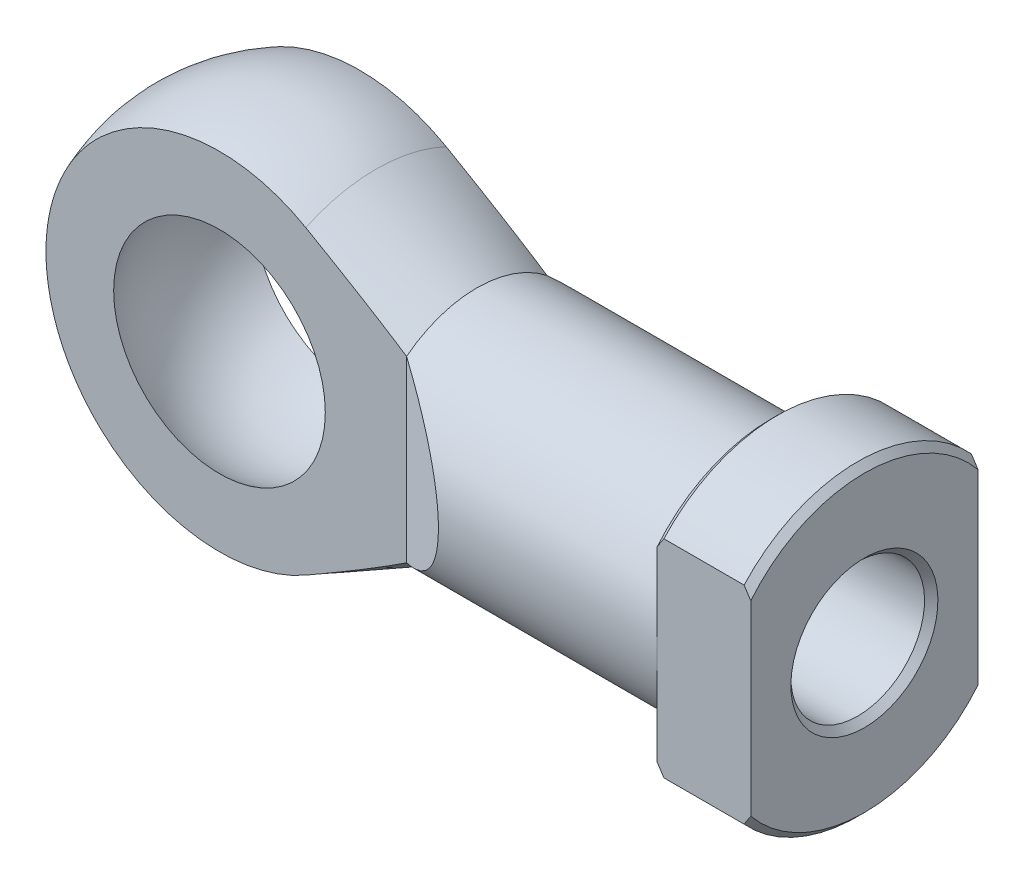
from build123d import *

# Parameters (mm, degrees)
ENL_V_MAT_EXTRU_2_DEPTH      = 48.339201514
ENL_V_MAT_EXTRU_2_DEPTH_BACK = 48.339201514
ENL_V_MAT_EXTRU_3_DEPTH      = 60.810116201
CHANFREIN1_SIZE              = 0.5


with BuildPart() as part:
    # Esquisse2 → Base-R_volution (revolve)
    with BuildSketch(Plane.XY, mode=Mode.PRIVATE) as base_r_volution_sk:
        with BuildLine():
            Line((43, 5), (43, 11.5))
            Line((43, 11.5), (36, 11.5))
            Line((36, 11.5), (36, 8.5))
            Line((36, 8.5), (14, 8.5))
            Line((14, 8.5), (6.458527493, 12.421248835))
            ThreePointArc((6.458527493, 12.421248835), (-7.265693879, 11.967025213), (-14, 0))
            Line((-14, 0), (23, 0))
            Line((23, 0), (23, 5))
            Line((23, 5), (43, 5))
        make_face()
    revolve(base_r_volution_sk.sketch.rotate(Axis((-14, 0, 0), (1, 0, 0)), 180), axis=Axis((-14, 0, 0), (1, 0, 0)))

    # Esquisse4 → Enl_v. mat.-Extru.2 (cut, two sides: drawn at the far end of the back side and taken through both)
    with BuildSketch(Plane(origin=(0, 0, 0), x_dir=(1, 0, 0), z_dir=(0, 1, 0)).offset(-ENL_V_MAT_EXTRU_2_DEPTH_BACK)):
        Polygon((-12.978347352, -5.25), (-12.978347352, -14), (29.155444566, -14), (14, -5.25), align=None)
        Polygon((-12.978347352, 5.25), (-12.978347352, 14), (29.155444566, 14), (14, 5.25), align=None)
    extrude(amount=ENL_V_MAT_EXTRU_2_DEPTH + ENL_V_MAT_EXTRU_2_DEPTH_BACK, mode=Mode.SUBTRACT)


with BuildPart() as enl_v_mat_extru_2_kept_piece:
    # of the separate pieces the step leaves, the one the design keeps (enl_v_mat_extru_2_pieces_kept)
    add(part.part.solids().sort_by_distance((43, -5, 0))[0])

    # Esquisse5 → Enl_vement de mati_re-R_volution1 (revolve, cut)
    with BuildSketch(Plane.XY):
        with BuildLine():
            Line((9.5, 0), (-9.5, 0))
            ThreePointArc((-9.5, 0), (0, 9.5), (9.5, 0))
        make_face()
    revolve(axis=Axis((-9.5, 0, 0), (1, 0, 0)), mode=Mode.SUBTRACT)

    # Esquisse6 → Enl_v. mat.-Extru.3 (cut, through all)
    with BuildSketch(Plane(origin=(43, 0, 0), x_dir=(0, 0, -1), z_dir=(1, 0, 0))):
        with BuildLine():
            Line((-8.5, 7.745966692), (-8.5, -7.745966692))
            ThreePointArc((-8.5, -7.745966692), (-11.5, 0), (-8.5, 7.745966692))
        make_face()
        with BuildLine():
            Line((8.5, 7.745966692), (8.5, -7.745966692))
            ThreePointArc((8.5, -7.745966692), (11.5, 0), (8.5, 7.745966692))
        make_face()
    extrude(amount=-ENL_V_MAT_EXTRU_3_DEPTH, mode=Mode.SUBTRACT)

    # Chanfrein1
    chanfrein1_edges = [enl_v_mat_extru_2_kept_piece.edges().sort_by_distance(p)[0] for p in [
        (43, 11.5, 0),
        (36, 11.5, 0),
        (43, 5, 0),
        (43, -11.5, 0),
        (36, -11.5, 0),
    ]]
    chamfer(chanfrein1_edges, length=CHANFREIN1_SIZE)


solid = enl_v_mat_extru_2_kept_piece.part
